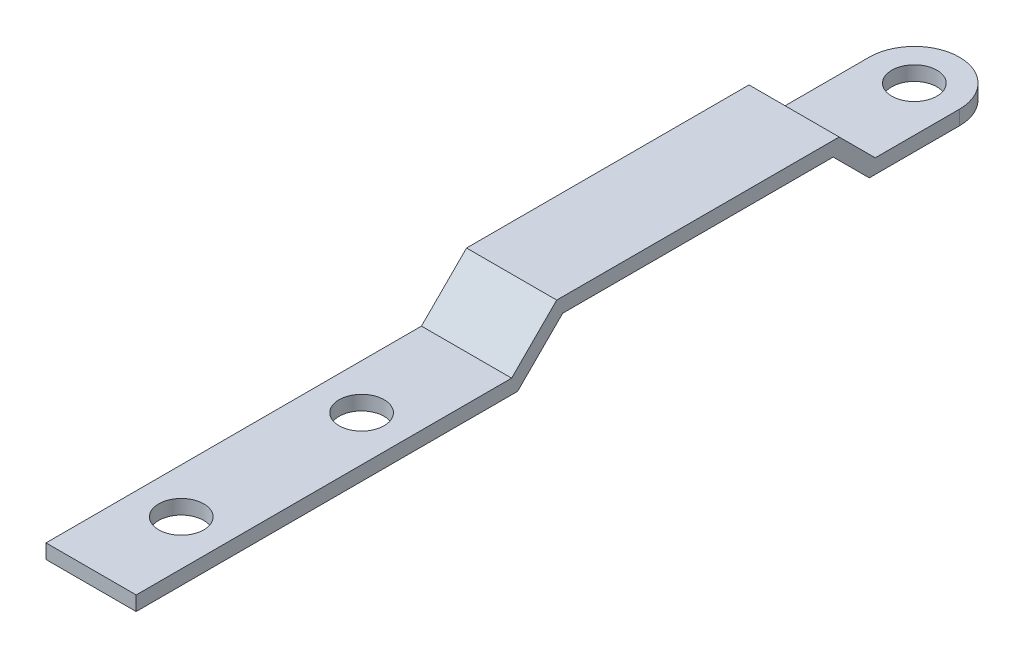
ISO-10303-21;
HEADER;
FILE_DESCRIPTION(('STEP AP214'),'2;1');
FILE_NAME('part.step','',(''),(''),'','','');
FILE_SCHEMA(('AUTOMOTIVE_DESIGN { 1 0 10303 214 1 1 1 1 }'));
ENDSEC;
DATA;
#1=APPLICATION_CONTEXT('core data for automotive mechanical design processes');
#2=APPLICATION_PROTOCOL_DEFINITION('international standard','automotive_design',2000,#1);
#3=PRODUCT_CONTEXT('',#1,'mechanical');
#4=PRODUCT('Part','Part','',(#3));
#5=PRODUCT_RELATED_PRODUCT_CATEGORY('part','',(#4));
#6=PRODUCT_DEFINITION_FORMATION('','',#4);
#7=PRODUCT_DEFINITION_CONTEXT('part definition',#1,'design');
#8=PRODUCT_DEFINITION('design','',#6,#7);
#9=PRODUCT_DEFINITION_SHAPE('','',#8);
#10=(LENGTH_UNIT() NAMED_UNIT(*) SI_UNIT(.MILLI.,.METRE.));
#11=(NAMED_UNIT(*) PLANE_ANGLE_UNIT() SI_UNIT($,.RADIAN.));
#12=(NAMED_UNIT(*) SI_UNIT($,.STERADIAN.) SOLID_ANGLE_UNIT());
#13=UNCERTAINTY_MEASURE_WITH_UNIT(LENGTH_MEASURE(1.E-05),#10,'distance_accuracy_value','');
#14=(GEOMETRIC_REPRESENTATION_CONTEXT(3) GLOBAL_UNCERTAINTY_ASSIGNED_CONTEXT((#13)) GLOBAL_UNIT_ASSIGNED_CONTEXT((#10,
#11,#12)) REPRESENTATION_CONTEXT('',''));
#15=CARTESIAN_POINT('',(0.,0.,0.));
#16=DIRECTION('',(0.,0.,1.));
#17=DIRECTION('',(1.,0.,0.));
#18=AXIS2_PLACEMENT_3D('',#15,#16,#17);
#19=CARTESIAN_POINT('',(0.,1.,-91.3));
#20=DIRECTION('',(0.,-1.,0.));
#21=DIRECTION('',(0.,0.,-1.));
#22=AXIS2_PLACEMENT_3D('',#19,#20,#21);
#23=CYLINDRICAL_SURFACE('',#22,5.);
#24=DIRECTION('',(0.,1.,0.));
#25=VECTOR('',#24,1.);
#26=CARTESIAN_POINT('',(5.,1.,-91.3));
#27=LINE('',#26,#25);
#28=CARTESIAN_POINT('',(5.,1.,-91.3));
#29=VERTEX_POINT('',#28);
#30=CARTESIAN_POINT('',(5.,2.6,-91.3));
#31=VERTEX_POINT('',#30);
#32=EDGE_CURVE('E129',#29,#31,#27,.T.);
#33=ORIENTED_EDGE('',*,*,#32,.F.);
#34=CARTESIAN_POINT('',(0.,1.,-91.3));
#35=DIRECTION('',(0.,1.,0.));
#36=DIRECTION('',(0.,0.,1.));
#37=AXIS2_PLACEMENT_3D('',#34,#35,#36);
#38=CIRCLE('',#37,5.);
#39=CARTESIAN_POINT('',(-5.,1.,-91.3));
#40=VERTEX_POINT('',#39);
#41=EDGE_CURVE('E43',#40,#29,#38,.F.);
#42=ORIENTED_EDGE('',*,*,#41,.F.);
#43=DIRECTION('',(0.,-1.,0.));
#44=VECTOR('',#43,1.);
#45=CARTESIAN_POINT('',(-5.,0.,-91.3));
#46=LINE('',#45,#44);
#47=CARTESIAN_POINT('',(-5.,2.6,-91.3));
#48=VERTEX_POINT('',#47);
#49=EDGE_CURVE('E214',#48,#40,#46,.T.);
#50=ORIENTED_EDGE('',*,*,#49,.F.);
#51=CARTESIAN_POINT('',(0.,2.6,-91.3));
#52=DIRECTION('',(0.,1.,0.));
#53=DIRECTION('',(0.,0.,1.));
#54=AXIS2_PLACEMENT_3D('',#51,#52,#53);
#55=CIRCLE('',#54,5.);
#56=EDGE_CURVE('E11',#31,#48,#55,.T.);
#57=ORIENTED_EDGE('',*,*,#56,.F.);
#58=EDGE_LOOP('',(#33,#42,#50,#57));
#59=FACE_BOUND('',#58,.T.);
#60=ADVANCED_FACE('F35',(#59),#23,.T.);
#61=CARTESIAN_POINT('',(5.,1.,-81.3));
#62=DIRECTION('',(0.,1.,0.));
#63=DIRECTION('',(0.,0.,1.));
#64=AXIS2_PLACEMENT_3D('',#61,#62,#63);
#65=PLANE('',#64);
#66=CARTESIAN_POINT('',(0.,1.,-91.3));
#67=DIRECTION('',(0.,1.,0.));
#68=DIRECTION('',(0.,0.,1.));
#69=AXIS2_PLACEMENT_3D('',#66,#67,#68);
#70=CIRCLE('',#69,2.5);
#71=CARTESIAN_POINT('',(0.,1.,-88.8));
#72=VERTEX_POINT('',#71);
#73=EDGE_CURVE('E169',#72,#72,#70,.T.);
#74=ORIENTED_EDGE('',*,*,#73,.T.);
#75=EDGE_LOOP('',(#74));
#76=FACE_BOUND('',#75,.T.);
#77=DIRECTION('',(0.,0.,-1.));
#78=VECTOR('',#77,1.);
#79=CARTESIAN_POINT('',(-5.,1.,-81.3));
#80=LINE('',#79,#78);
#81=CARTESIAN_POINT('',(-5.,1.,-81.3));
#82=VERTEX_POINT('',#81);
#83=EDGE_CURVE('E166',#82,#40,#80,.T.);
#84=ORIENTED_EDGE('',*,*,#83,.T.);
#85=ORIENTED_EDGE('',*,*,#41,.T.);
#86=DIRECTION('',(0.,0.,-1.));
#87=VECTOR('',#86,1.);
#88=CARTESIAN_POINT('',(5.,1.,-81.3));
#89=LINE('',#88,#87);
#90=CARTESIAN_POINT('',(5.,1.,-81.3));
#91=VERTEX_POINT('',#90);
#92=EDGE_CURVE('E140',#91,#29,#89,.T.);
#93=ORIENTED_EDGE('',*,*,#92,.F.);
#94=DIRECTION('',(-1.,0.,0.));
#95=VECTOR('',#94,1.);
#96=CARTESIAN_POINT('',(5.,1.,-81.3));
#97=LINE('',#96,#95);
#98=EDGE_CURVE('E165',#91,#82,#97,.T.);
#99=ORIENTED_EDGE('',*,*,#98,.T.);
#100=EDGE_LOOP('',(#84,#85,#93,#99));
#101=FACE_BOUND('',#100,.T.);
#102=ADVANCED_FACE('F217',(#76,#101),#65,.F.);
#103=CARTESIAN_POINT('',(5.,2.6,-81.3));
#104=DIRECTION('',(0.,1.,0.));
#105=DIRECTION('',(0.,0.,1.));
#106=AXIS2_PLACEMENT_3D('',#103,#104,#105);
#107=PLANE('',#106);
#108=CARTESIAN_POINT('',(0.,2.6,-91.3));
#109=DIRECTION('',(0.,1.,0.));
#110=DIRECTION('',(0.,0.,1.));
#111=AXIS2_PLACEMENT_3D('',#108,#109,#110);
#112=CIRCLE('',#111,2.5);
#113=CARTESIAN_POINT('',(0.,2.6,-88.8));
#114=VERTEX_POINT('',#113);
#115=EDGE_CURVE('E230',#114,#114,#112,.T.);
#116=ORIENTED_EDGE('',*,*,#115,.F.);
#117=EDGE_LOOP('',(#116));
#118=FACE_BOUND('',#117,.T.);
#119=DIRECTION('',(0.,0.,-1.));
#120=VECTOR('',#119,1.);
#121=CARTESIAN_POINT('',(5.,2.6,-81.3));
#122=LINE('',#121,#120);
#123=CARTESIAN_POINT('',(5.,2.6,-81.962741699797));
#124=VERTEX_POINT('',#123);
#125=EDGE_CURVE('E122',#124,#31,#122,.T.);
#126=ORIENTED_EDGE('',*,*,#125,.T.);
#127=ORIENTED_EDGE('',*,*,#56,.T.);
#128=DIRECTION('',(0.,0.,-1.));
#129=VECTOR('',#128,1.);
#130=CARTESIAN_POINT('',(-5.,2.6,-81.3));
#131=LINE('',#130,#129);
#132=CARTESIAN_POINT('',(-5.,2.6,-81.962741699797));
#133=VERTEX_POINT('',#132);
#134=EDGE_CURVE('E124',#133,#48,#131,.T.);
#135=ORIENTED_EDGE('',*,*,#134,.F.);
#136=DIRECTION('',(-1.,0.,0.));
#137=VECTOR('',#136,1.);
#138=CARTESIAN_POINT('',(5.,2.6,-81.962741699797));
#139=LINE('',#138,#137);
#140=EDGE_CURVE('E119',#124,#133,#139,.T.);
#141=ORIENTED_EDGE('',*,*,#140,.F.);
#142=EDGE_LOOP('',(#126,#127,#135,#141));
#143=FACE_BOUND('',#142,.T.);
#144=ADVANCED_FACE('F121',(#118,#143),#107,.T.);
#145=CARTESIAN_POINT('',(5.,6.13137084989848,-78.4313708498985));
#146=DIRECTION('',(0.,0.707106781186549,-0.707106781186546));
#147=DIRECTION('',(0.,0.707106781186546,0.707106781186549));
#148=AXIS2_PLACEMENT_3D('',#145,#146,#147);
#149=PLANE('',#148);
#150=DIRECTION('',(0.,-0.707106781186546,-0.707106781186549));
#151=VECTOR('',#150,1.);
#152=CARTESIAN_POINT('',(-5.,6.13137084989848,-78.4313708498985));
#153=LINE('',#152,#151);
#154=CARTESIAN_POINT('',(-5.,6.6,-77.9627416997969));
#155=VERTEX_POINT('',#154);
#156=EDGE_CURVE('E171',#155,#133,#153,.T.);
#157=ORIENTED_EDGE('',*,*,#156,.F.);
#158=DIRECTION('',(-1.,0.,0.));
#159=VECTOR('',#158,1.);
#160=CARTESIAN_POINT('',(5.,6.6,-77.9627416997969));
#161=LINE('',#160,#159);
#162=CARTESIAN_POINT('',(5.,6.6,-77.9627416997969));
#163=VERTEX_POINT('',#162);
#164=EDGE_CURVE('E130',#163,#155,#161,.T.);
#165=ORIENTED_EDGE('',*,*,#164,.F.);
#166=DIRECTION('',(0.,-0.707106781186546,-0.707106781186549));
#167=VECTOR('',#166,1.);
#168=CARTESIAN_POINT('',(5.,6.13137084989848,-78.4313708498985));
#169=LINE('',#168,#167);
#170=EDGE_CURVE('E138',#163,#124,#169,.T.);
#171=ORIENTED_EDGE('',*,*,#170,.T.);
#172=ORIENTED_EDGE('',*,*,#140,.T.);
#173=EDGE_LOOP('',(#157,#165,#171,#172));
#174=FACE_BOUND('',#173,.T.);
#175=ADVANCED_FACE('F142',(#174),#149,.T.);
#176=CARTESIAN_POINT('',(5.,6.6,-47.3));
#177=DIRECTION('',(0.,1.,0.));
#178=DIRECTION('',(0.,0.,1.));
#179=AXIS2_PLACEMENT_3D('',#176,#177,#178);
#180=PLANE('',#179);
#181=DIRECTION('',(0.,0.,-1.));
#182=VECTOR('',#181,1.);
#183=CARTESIAN_POINT('',(-5.,6.6,-47.3));
#184=LINE('',#183,#182);
#185=CARTESIAN_POINT('',(-5.,6.6,-46.637258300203));
#186=VERTEX_POINT('',#185);
#187=EDGE_CURVE('E173',#186,#155,#184,.T.);
#188=ORIENTED_EDGE('',*,*,#187,.F.);
#189=DIRECTION('',(-1.,0.,0.));
#190=VECTOR('',#189,1.);
#191=CARTESIAN_POINT('',(5.,6.6,-46.637258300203));
#192=LINE('',#191,#190);
#193=CARTESIAN_POINT('',(5.,6.6,-46.637258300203));
#194=VERTEX_POINT('',#193);
#195=EDGE_CURVE('E210',#194,#186,#192,.T.);
#196=ORIENTED_EDGE('',*,*,#195,.F.);
#197=DIRECTION('',(0.,0.,-1.));
#198=VECTOR('',#197,1.);
#199=CARTESIAN_POINT('',(5.,6.6,-47.3));
#200=LINE('',#199,#198);
#201=EDGE_CURVE('E143',#194,#163,#200,.T.);
#202=ORIENTED_EDGE('',*,*,#201,.T.);
#203=ORIENTED_EDGE('',*,*,#164,.T.);
#204=EDGE_LOOP('',(#188,#196,#202,#203));
#205=FACE_BOUND('',#204,.T.);
#206=ADVANCED_FACE('F249',(#205),#180,.T.);
#207=CARTESIAN_POINT('',(5.,1.13137084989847,-41.1686291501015));
#208=DIRECTION('',(0.,0.707106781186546,0.707106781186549));
#209=DIRECTION('',(0.,-0.707106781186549,0.707106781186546));
#210=AXIS2_PLACEMENT_3D('',#207,#208,#209);
#211=PLANE('',#210);
#212=DIRECTION('',(0.,0.707106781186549,-0.707106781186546));
#213=VECTOR('',#212,1.);
#214=CARTESIAN_POINT('',(-5.,1.13137084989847,-41.1686291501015));
#215=LINE('',#214,#213);
#216=CARTESIAN_POINT('',(-5.,1.6,-41.637258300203));
#217=VERTEX_POINT('',#216);
#218=EDGE_CURVE('E176',#217,#186,#215,.T.);
#219=ORIENTED_EDGE('',*,*,#218,.F.);
#220=DIRECTION('',(-1.,0.,0.));
#221=VECTOR('',#220,1.);
#222=CARTESIAN_POINT('',(5.,1.6,-41.637258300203));
#223=LINE('',#222,#221);
#224=CARTESIAN_POINT('',(5.,1.6,-41.637258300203));
#225=VERTEX_POINT('',#224);
#226=EDGE_CURVE('E208',#225,#217,#223,.T.);
#227=ORIENTED_EDGE('',*,*,#226,.F.);
#228=DIRECTION('',(0.,0.707106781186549,-0.707106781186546));
#229=VECTOR('',#228,1.);
#230=CARTESIAN_POINT('',(5.,1.13137084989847,-41.1686291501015));
#231=LINE('',#230,#229);
#232=EDGE_CURVE('E145',#225,#194,#231,.T.);
#233=ORIENTED_EDGE('',*,*,#232,.T.);
#234=ORIENTED_EDGE('',*,*,#195,.T.);
#235=EDGE_LOOP('',(#219,#227,#233,#234));
#236=FACE_BOUND('',#235,.T.);
#237=ADVANCED_FACE('F282',(#236),#211,.T.);
#238=CARTESIAN_POINT('',(5.,1.6,0.));
#239=DIRECTION('',(0.,1.,0.));
#240=DIRECTION('',(0.,0.,1.));
#241=AXIS2_PLACEMENT_3D('',#238,#239,#240);
#242=PLANE('',#241);
#243=CARTESIAN_POINT('',(0.,1.6,-30.));
#244=DIRECTION('',(0.,1.,0.));
#245=DIRECTION('',(0.,0.,1.));
#246=AXIS2_PLACEMENT_3D('',#243,#244,#245);
#247=CIRCLE('',#246,2.5);
#248=CARTESIAN_POINT('',(0.,1.6,-27.5));
#249=VERTEX_POINT('',#248);
#250=EDGE_CURVE('E224',#249,#249,#247,.T.);
#251=ORIENTED_EDGE('',*,*,#250,.F.);
#252=EDGE_LOOP('',(#251));
#253=FACE_BOUND('',#252,.T.);
#254=CARTESIAN_POINT('',(0.,1.6,-10.));
#255=DIRECTION('',(0.,1.,0.));
#256=DIRECTION('',(0.,0.,1.));
#257=AXIS2_PLACEMENT_3D('',#254,#255,#256);
#258=CIRCLE('',#257,2.5);
#259=CARTESIAN_POINT('',(0.,1.6,-7.5));
#260=VERTEX_POINT('',#259);
#261=EDGE_CURVE('E227',#260,#260,#258,.T.);
#262=ORIENTED_EDGE('',*,*,#261,.F.);
#263=EDGE_LOOP('',(#262));
#264=FACE_BOUND('',#263,.T.);
#265=DIRECTION('',(0.,0.,-1.));
#266=VECTOR('',#265,1.);
#267=CARTESIAN_POINT('',(-5.,1.6,0.));
#268=LINE('',#267,#266);
#269=CARTESIAN_POINT('',(-5.,1.6,0.));
#270=VERTEX_POINT('',#269);
#271=EDGE_CURVE('E179',#270,#217,#268,.T.);
#272=ORIENTED_EDGE('',*,*,#271,.F.);
#273=DIRECTION('',(-1.,0.,0.));
#274=VECTOR('',#273,1.);
#275=CARTESIAN_POINT('',(5.,1.6,0.));
#276=LINE('',#275,#274);
#277=CARTESIAN_POINT('',(5.,1.6,0.));
#278=VERTEX_POINT('',#277);
#279=EDGE_CURVE('E206',#278,#270,#276,.T.);
#280=ORIENTED_EDGE('',*,*,#279,.F.);
#281=DIRECTION('',(0.,0.,-1.));
#282=VECTOR('',#281,1.);
#283=CARTESIAN_POINT('',(5.,1.6,0.));
#284=LINE('',#283,#282);
#285=EDGE_CURVE('E151',#278,#225,#284,.T.);
#286=ORIENTED_EDGE('',*,*,#285,.T.);
#287=ORIENTED_EDGE('',*,*,#226,.T.);
#288=EDGE_LOOP('',(#272,#280,#286,#287));
#289=FACE_BOUND('',#288,.T.);
#290=ADVANCED_FACE('F276',(#253,#264,#289),#242,.T.);
#291=CARTESIAN_POINT('',(5.,0.,0.));
#292=DIRECTION('',(0.,0.,1.));
#293=DIRECTION('',(1.,0.,0.));
#294=AXIS2_PLACEMENT_3D('',#291,#292,#293);
#295=PLANE('',#294);
#296=DIRECTION('',(0.,1.,0.));
#297=VECTOR('',#296,1.);
#298=CARTESIAN_POINT('',(-5.,0.,0.));
#299=LINE('',#298,#297);
#300=CARTESIAN_POINT('',(-5.,0.,0.));
#301=VERTEX_POINT('',#300);
#302=EDGE_CURVE('E182',#301,#270,#299,.T.);
#303=ORIENTED_EDGE('',*,*,#302,.F.);
#304=DIRECTION('',(-1.,0.,0.));
#305=VECTOR('',#304,1.);
#306=CARTESIAN_POINT('',(5.,0.,0.));
#307=LINE('',#306,#305);
#308=CARTESIAN_POINT('',(5.,0.,0.));
#309=VERTEX_POINT('',#308);
#310=EDGE_CURVE('E204',#309,#301,#307,.T.);
#311=ORIENTED_EDGE('',*,*,#310,.F.);
#312=DIRECTION('',(0.,1.,0.));
#313=VECTOR('',#312,1.);
#314=CARTESIAN_POINT('',(5.,0.,0.));
#315=LINE('',#314,#313);
#316=EDGE_CURVE('E154',#309,#278,#315,.T.);
#317=ORIENTED_EDGE('',*,*,#316,.T.);
#318=ORIENTED_EDGE('',*,*,#279,.T.);
#319=EDGE_LOOP('',(#303,#311,#317,#318));
#320=FACE_BOUND('',#319,.T.);
#321=ADVANCED_FACE('F281',(#320),#295,.T.);
#322=CARTESIAN_POINT('',(5.,0.,0.));
#323=DIRECTION('',(0.,1.,0.));
#324=DIRECTION('',(0.,0.,1.));
#325=AXIS2_PLACEMENT_3D('',#322,#323,#324);
#326=PLANE('',#325);
#327=CARTESIAN_POINT('',(0.,0.,-30.));
#328=DIRECTION('',(0.,1.,0.));
#329=DIRECTION('',(0.,0.,1.));
#330=AXIS2_PLACEMENT_3D('',#327,#328,#329);
#331=CIRCLE('',#330,2.5);
#332=CARTESIAN_POINT('',(0.,0.,-27.5));
#333=VERTEX_POINT('',#332);
#334=EDGE_CURVE('E234',#333,#333,#331,.T.);
#335=ORIENTED_EDGE('',*,*,#334,.T.);
#336=EDGE_LOOP('',(#335));
#337=FACE_BOUND('',#336,.T.);
#338=CARTESIAN_POINT('',(0.,0.,-10.));
#339=DIRECTION('',(0.,1.,0.));
#340=DIRECTION('',(0.,0.,1.));
#341=AXIS2_PLACEMENT_3D('',#338,#339,#340);
#342=CIRCLE('',#341,2.5);
#343=CARTESIAN_POINT('',(0.,0.,-7.5));
#344=VERTEX_POINT('',#343);
#345=EDGE_CURVE('E231',#344,#344,#342,.T.);
#346=ORIENTED_EDGE('',*,*,#345,.T.);
#347=EDGE_LOOP('',(#346));
#348=FACE_BOUND('',#347,.T.);
#349=DIRECTION('',(0.,0.,-1.));
#350=VECTOR('',#349,1.);
#351=CARTESIAN_POINT('',(-5.,0.,0.));
#352=LINE('',#351,#350);
#353=CARTESIAN_POINT('',(-5.,0.,-42.3));
#354=VERTEX_POINT('',#353);
#355=EDGE_CURVE('E185',#301,#354,#352,.T.);
#356=ORIENTED_EDGE('',*,*,#355,.T.);
#357=DIRECTION('',(-1.,0.,0.));
#358=VECTOR('',#357,1.);
#359=CARTESIAN_POINT('',(5.,0.,-42.3));
#360=LINE('',#359,#358);
#361=CARTESIAN_POINT('',(5.,0.,-42.3));
#362=VERTEX_POINT('',#361);
#363=EDGE_CURVE('E201',#362,#354,#360,.T.);
#364=ORIENTED_EDGE('',*,*,#363,.F.);
#365=DIRECTION('',(0.,0.,-1.));
#366=VECTOR('',#365,1.);
#367=CARTESIAN_POINT('',(5.,0.,0.));
#368=LINE('',#367,#366);
#369=EDGE_CURVE('E157',#309,#362,#368,.T.);
#370=ORIENTED_EDGE('',*,*,#369,.F.);
#371=ORIENTED_EDGE('',*,*,#310,.T.);
#372=EDGE_LOOP('',(#356,#364,#370,#371));
#373=FACE_BOUND('',#372,.T.);
#374=ADVANCED_FACE('F292',(#337,#348,#373),#326,.F.);
#375=CARTESIAN_POINT('',(5.,0.,-42.3));
#376=DIRECTION('',(0.,0.707106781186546,0.707106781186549));
#377=DIRECTION('',(0.,-0.707106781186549,0.707106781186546));
#378=AXIS2_PLACEMENT_3D('',#375,#376,#377);
#379=PLANE('',#378);
#380=DIRECTION('',(0.,0.707106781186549,-0.707106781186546));
#381=VECTOR('',#380,1.);
#382=CARTESIAN_POINT('',(-5.,0.,-42.3));
#383=LINE('',#382,#381);
#384=CARTESIAN_POINT('',(-5.,5.,-47.3));
#385=VERTEX_POINT('',#384);
#386=EDGE_CURVE('E187',#354,#385,#383,.T.);
#387=ORIENTED_EDGE('',*,*,#386,.T.);
#388=DIRECTION('',(-1.,0.,0.));
#389=VECTOR('',#388,1.);
#390=CARTESIAN_POINT('',(5.,5.,-47.3));
#391=LINE('',#390,#389);
#392=CARTESIAN_POINT('',(5.,5.,-47.3));
#393=VERTEX_POINT('',#392);
#394=EDGE_CURVE('E198',#393,#385,#391,.T.);
#395=ORIENTED_EDGE('',*,*,#394,.F.);
#396=DIRECTION('',(0.,0.707106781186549,-0.707106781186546));
#397=VECTOR('',#396,1.);
#398=CARTESIAN_POINT('',(5.,0.,-42.3));
#399=LINE('',#398,#397);
#400=EDGE_CURVE('E159',#362,#393,#399,.T.);
#401=ORIENTED_EDGE('',*,*,#400,.F.);
#402=ORIENTED_EDGE('',*,*,#363,.T.);
#403=EDGE_LOOP('',(#387,#395,#401,#402));
#404=FACE_BOUND('',#403,.T.);
#405=ADVANCED_FACE('F297',(#404),#379,.F.);
#406=CARTESIAN_POINT('',(5.,5.,-47.3));
#407=DIRECTION('',(0.,1.,0.));
#408=DIRECTION('',(0.,0.,1.));
#409=AXIS2_PLACEMENT_3D('',#406,#407,#408);
#410=PLANE('',#409);
#411=DIRECTION('',(0.,0.,-1.));
#412=VECTOR('',#411,1.);
#413=CARTESIAN_POINT('',(-5.,5.,-47.3));
#414=LINE('',#413,#412);
#415=CARTESIAN_POINT('',(-5.,5.,-77.3));
#416=VERTEX_POINT('',#415);
#417=EDGE_CURVE('E189',#385,#416,#414,.T.);
#418=ORIENTED_EDGE('',*,*,#417,.T.);
#419=DIRECTION('',(-1.,0.,0.));
#420=VECTOR('',#419,1.);
#421=CARTESIAN_POINT('',(5.,5.,-77.3));
#422=LINE('',#421,#420);
#423=CARTESIAN_POINT('',(5.,5.,-77.3));
#424=VERTEX_POINT('',#423);
#425=EDGE_CURVE('E195',#424,#416,#422,.T.);
#426=ORIENTED_EDGE('',*,*,#425,.F.);
#427=DIRECTION('',(0.,0.,-1.));
#428=VECTOR('',#427,1.);
#429=CARTESIAN_POINT('',(5.,5.,-47.3));
#430=LINE('',#429,#428);
#431=EDGE_CURVE('E161',#393,#424,#430,.T.);
#432=ORIENTED_EDGE('',*,*,#431,.F.);
#433=ORIENTED_EDGE('',*,*,#394,.T.);
#434=EDGE_LOOP('',(#418,#426,#432,#433));
#435=FACE_BOUND('',#434,.T.);
#436=ADVANCED_FACE('F340',(#435),#410,.F.);
#437=CARTESIAN_POINT('',(5.,5.,-77.3));
#438=DIRECTION('',(0.,0.707106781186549,-0.707106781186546));
#439=DIRECTION('',(0.,0.707106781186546,0.707106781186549));
#440=AXIS2_PLACEMENT_3D('',#437,#438,#439);
#441=PLANE('',#440);
#442=DIRECTION('',(0.,-0.707106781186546,-0.707106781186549));
#443=VECTOR('',#442,1.);
#444=CARTESIAN_POINT('',(-5.,5.,-77.3));
#445=LINE('',#444,#443);
#446=EDGE_CURVE('E191',#416,#82,#445,.T.);
#447=ORIENTED_EDGE('',*,*,#446,.T.);
#448=ORIENTED_EDGE('',*,*,#98,.F.);
#449=DIRECTION('',(0.,-0.707106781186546,-0.707106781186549));
#450=VECTOR('',#449,1.);
#451=CARTESIAN_POINT('',(5.,5.,-77.3));
#452=LINE('',#451,#450);
#453=EDGE_CURVE('E163',#424,#91,#452,.T.);
#454=ORIENTED_EDGE('',*,*,#453,.F.);
#455=ORIENTED_EDGE('',*,*,#425,.T.);
#456=EDGE_LOOP('',(#447,#448,#454,#455));
#457=FACE_BOUND('',#456,.T.);
#458=ADVANCED_FACE('F335',(#457),#441,.F.);
#459=CARTESIAN_POINT('',(5.,0.,0.));
#460=DIRECTION('',(-1.,0.,0.));
#461=DIRECTION('',(0.,0.,1.));
#462=AXIS2_PLACEMENT_3D('',#459,#460,#461);
#463=PLANE('',#462);
#464=ORIENTED_EDGE('',*,*,#92,.T.);
#465=ORIENTED_EDGE('',*,*,#32,.T.);
#466=ORIENTED_EDGE('',*,*,#125,.F.);
#467=ORIENTED_EDGE('',*,*,#170,.F.);
#468=ORIENTED_EDGE('',*,*,#201,.F.);
#469=ORIENTED_EDGE('',*,*,#232,.F.);
#470=ORIENTED_EDGE('',*,*,#285,.F.);
#471=ORIENTED_EDGE('',*,*,#316,.F.);
#472=ORIENTED_EDGE('',*,*,#369,.T.);
#473=ORIENTED_EDGE('',*,*,#400,.T.);
#474=ORIENTED_EDGE('',*,*,#431,.T.);
#475=ORIENTED_EDGE('',*,*,#453,.T.);
#476=EDGE_LOOP('',(#464,#465,#466,#467,#468,#469,#470,#471,#472,#473,#474,#475));
#477=FACE_BOUND('',#476,.T.);
#478=ADVANCED_FACE('F136',(#477),#463,.F.);
#479=CARTESIAN_POINT('',(-5.,0.,0.));
#480=DIRECTION('',(-1.,0.,0.));
#481=DIRECTION('',(0.,0.,1.));
#482=AXIS2_PLACEMENT_3D('',#479,#480,#481);
#483=PLANE('',#482);
#484=ORIENTED_EDGE('',*,*,#134,.T.);
#485=ORIENTED_EDGE('',*,*,#49,.T.);
#486=ORIENTED_EDGE('',*,*,#83,.F.);
#487=ORIENTED_EDGE('',*,*,#446,.F.);
#488=ORIENTED_EDGE('',*,*,#417,.F.);
#489=ORIENTED_EDGE('',*,*,#386,.F.);
#490=ORIENTED_EDGE('',*,*,#355,.F.);
#491=ORIENTED_EDGE('',*,*,#302,.T.);
#492=ORIENTED_EDGE('',*,*,#271,.T.);
#493=ORIENTED_EDGE('',*,*,#218,.T.);
#494=ORIENTED_EDGE('',*,*,#187,.T.);
#495=ORIENTED_EDGE('',*,*,#156,.T.);
#496=EDGE_LOOP('',(#484,#485,#486,#487,#488,#489,#490,#491,#492,#493,#494,#495));
#497=FACE_BOUND('',#496,.T.);
#498=ADVANCED_FACE('F267',(#497),#483,.T.);
#499=CARTESIAN_POINT('',(0.,0.,-10.));
#500=DIRECTION('',(0.,1.,0.));
#501=DIRECTION('',(0.,0.,1.));
#502=AXIS2_PLACEMENT_3D('',#499,#500,#501);
#503=CYLINDRICAL_SURFACE('',#502,2.5);
#504=ORIENTED_EDGE('',*,*,#261,.T.);
#505=EDGE_LOOP('',(#504));
#506=FACE_BOUND('',#505,.T.);
#507=ORIENTED_EDGE('',*,*,#345,.F.);
#508=EDGE_LOOP('',(#507));
#509=FACE_BOUND('',#508,.T.);
#510=ADVANCED_FACE('F305',(#506,#509),#503,.F.);
#511=CARTESIAN_POINT('',(0.,0.,-30.));
#512=DIRECTION('',(0.,1.,0.));
#513=DIRECTION('',(0.,0.,1.));
#514=AXIS2_PLACEMENT_3D('',#511,#512,#513);
#515=CYLINDRICAL_SURFACE('',#514,2.5);
#516=ORIENTED_EDGE('',*,*,#250,.T.);
#517=EDGE_LOOP('',(#516));
#518=FACE_BOUND('',#517,.T.);
#519=ORIENTED_EDGE('',*,*,#334,.F.);
#520=EDGE_LOOP('',(#519));
#521=FACE_BOUND('',#520,.T.);
#522=ADVANCED_FACE('F310',(#518,#521),#515,.F.);
#523=CARTESIAN_POINT('',(0.,0.,-91.3));
#524=DIRECTION('',(0.,1.,0.));
#525=DIRECTION('',(0.,0.,1.));
#526=AXIS2_PLACEMENT_3D('',#523,#524,#525);
#527=CYLINDRICAL_SURFACE('',#526,2.5);
#528=ORIENTED_EDGE('',*,*,#115,.T.);
#529=EDGE_LOOP('',(#528));
#530=FACE_BOUND('',#529,.T.);
#531=ORIENTED_EDGE('',*,*,#73,.F.);
#532=EDGE_LOOP('',(#531));
#533=FACE_BOUND('',#532,.T.);
#534=ADVANCED_FACE('F240',(#530,#533),#527,.F.);
#535=CLOSED_SHELL('',(#60,#102,#144,#175,#206,#237,#290,#321,#374,#405,#436,#458,#478,#498,#510,
#522,#534));
#536=MANIFOLD_SOLID_BREP('B2',#535);
#537=ADVANCED_BREP_SHAPE_REPRESENTATION('',(#18,#536),#14);
#538=SHAPE_DEFINITION_REPRESENTATION(#9,#537);
ENDSEC;
END-ISO-10303-21;
